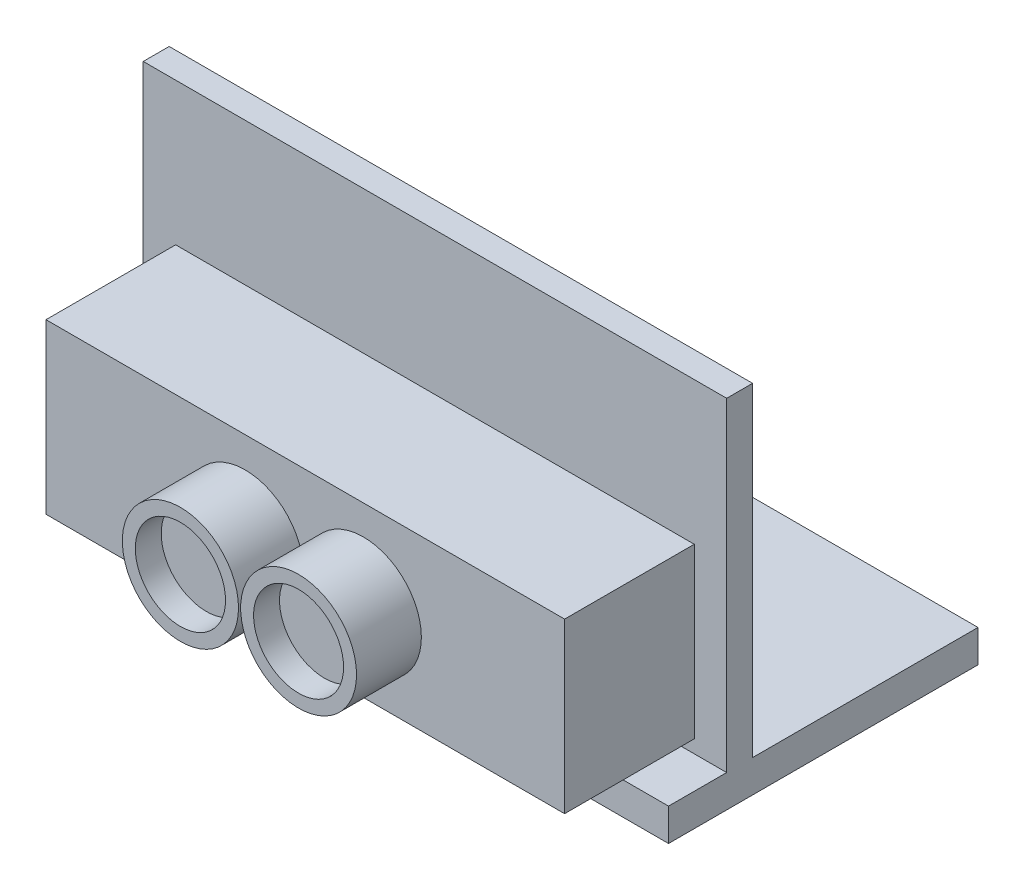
from build123d import *

# Parameters (mm, degrees)
SKETCH1_W            = 45
SKETCH1_H            = 25
BOSS_EXTRUDE1_DEPTH  = 2
SKETCH2_W            = 40
SKETCH2_H            = 13
BOSS_EXTRUDE2_DEPTH  = 10
SKETCH9_R            = 4.469817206
SKETCH9_R_2          = 4.480165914
BOSS_EXTRUDE8_DEPTH  = 5
SKETCH10_R           = 3.469817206
SKETCH10_R_2         = 3.480165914
CUT_EXTRUDE5_DEPTH   = 2
SKETCH12_W           = 45
SKETCH12_H           = 23.870594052
BOSS_EXTRUDE11_DEPTH = 2.5
SKETCH13_R           = 1.5
CUT_EXTRUDE6_DEPTH   = 2.5


with BuildPart() as part:
    # Sketch1 → Boss-Extrude1 (new body)
    with BuildSketch(Plane.XY):
        Rectangle(SKETCH1_W, SKETCH1_H)
    extrude(amount=BOSS_EXTRUDE1_DEPTH)

    # Sketch2 → Boss-Extrude2 (add)
    with BuildSketch(Plane.XY.offset(2)):
        with Locations((0, -5)):
            Rectangle(SKETCH2_W, SKETCH2_H)
    extrude(amount=BOSS_EXTRUDE2_DEPTH)

    # Sketch9 → Boss-Extrude8 (add)
    with BuildSketch(Plane.XY.offset(12)):
        with Locations((4.481856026, -5.240684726)):
            Circle(SKETCH9_R)
        with Locations((-4.632994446, -5.330904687)):
            Circle(SKETCH9_R_2)
    extrude(amount=BOSS_EXTRUDE8_DEPTH)

    # Sketch10 → Cut-Extrude5 (cut)
    with BuildSketch(Plane.XY.offset(17)):
        with Locations((4.481856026, -5.240684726)):
            Circle(SKETCH10_R)
        with Locations((-4.632994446, -5.330904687)):
            Circle(SKETCH10_R_2)
    extrude(amount=-CUT_EXTRUDE5_DEPTH, mode=Mode.SUBTRACT)

    # Sketch12 → Boss-Extrude11 (add)
    with BuildSketch(Plane.XZ.offset(12.5)):
        with Locations((0, -5.450175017)):
            Rectangle(SKETCH12_W, SKETCH12_H)
    extrude(amount=BOSS_EXTRUDE11_DEPTH)

    # Sketch13 → Cut-Extrude6 (cut)
    with BuildSketch(Plane(origin=(0, -12.5, 0), x_dir=(1, 0, 0), z_dir=(0, 1, 0))):
        with Locations(Location((-0.152828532, 13.748145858, 0), (0, 0, 270))):
            Circle(SKETCH13_R)
    extrude(amount=-CUT_EXTRUDE6_DEPTH, mode=Mode.SUBTRACT)


solid = part.part
